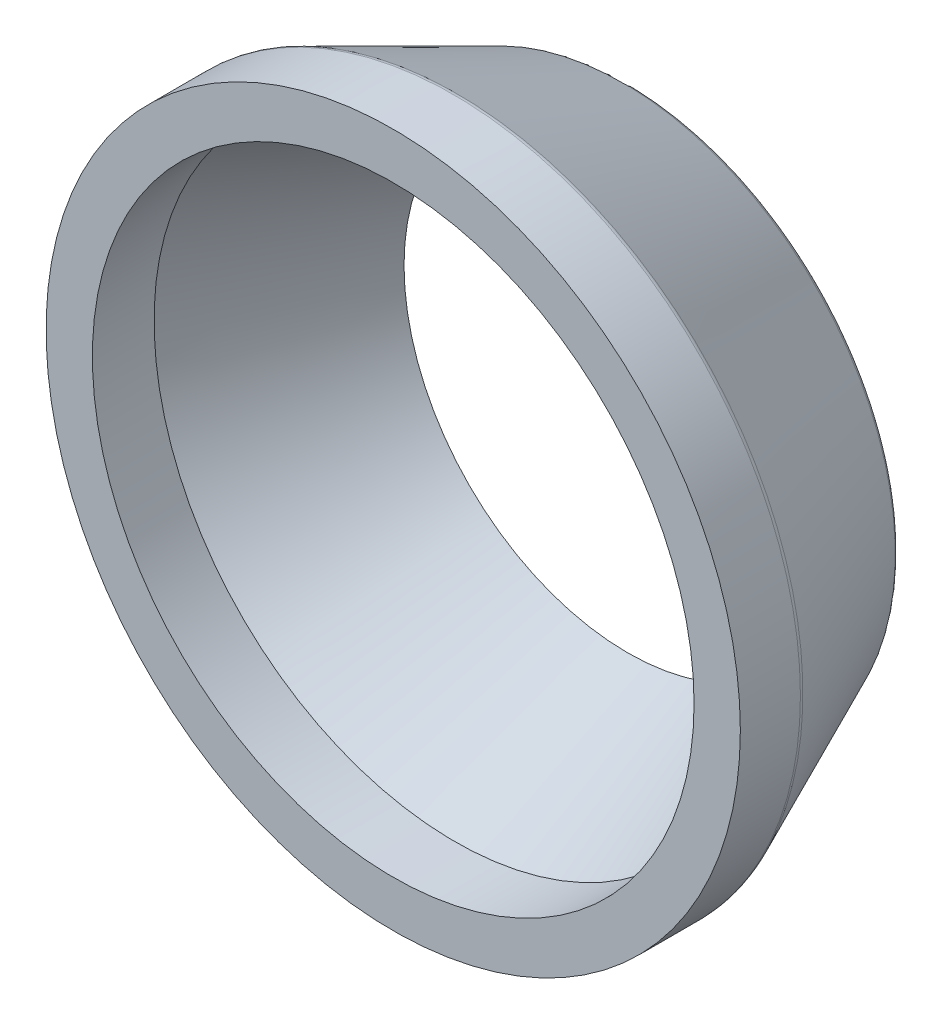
ISO-10303-21;
HEADER;
FILE_DESCRIPTION(('STEP AP214'),'2;1');
FILE_NAME('part.step','',(''),(''),'','','');
FILE_SCHEMA(('AUTOMOTIVE_DESIGN { 1 0 10303 214 1 1 1 1 }'));
ENDSEC;
DATA;
#1=APPLICATION_CONTEXT('core data for automotive mechanical design processes');
#2=APPLICATION_PROTOCOL_DEFINITION('international standard','automotive_design',2000,#1);
#3=PRODUCT_CONTEXT('',#1,'mechanical');
#4=PRODUCT('Part','Part','',(#3));
#5=PRODUCT_RELATED_PRODUCT_CATEGORY('part','',(#4));
#6=PRODUCT_DEFINITION_FORMATION('','',#4);
#7=PRODUCT_DEFINITION_CONTEXT('part definition',#1,'design');
#8=PRODUCT_DEFINITION('design','',#6,#7);
#9=PRODUCT_DEFINITION_SHAPE('','',#8);
#10=(LENGTH_UNIT() NAMED_UNIT(*) SI_UNIT(.MILLI.,.METRE.));
#11=(NAMED_UNIT(*) PLANE_ANGLE_UNIT() SI_UNIT($,.RADIAN.));
#12=(NAMED_UNIT(*) SI_UNIT($,.STERADIAN.) SOLID_ANGLE_UNIT());
#13=UNCERTAINTY_MEASURE_WITH_UNIT(LENGTH_MEASURE(1.E-05),#10,'distance_accuracy_value','');
#14=(GEOMETRIC_REPRESENTATION_CONTEXT(3) GLOBAL_UNCERTAINTY_ASSIGNED_CONTEXT((#13)) GLOBAL_UNIT_ASSIGNED_CONTEXT((#10,
#11,#12)) REPRESENTATION_CONTEXT('',''));
#15=CARTESIAN_POINT('',(0.,0.,0.));
#16=DIRECTION('',(0.,0.,1.));
#17=DIRECTION('',(1.,0.,0.));
#18=AXIS2_PLACEMENT_3D('',#15,#16,#17);
#19=CARTESIAN_POINT('',(19.5,0.,0.));
#20=DIRECTION('',(0.,0.,1.));
#21=DIRECTION('',(1.,0.,0.));
#22=AXIS2_PLACEMENT_3D('',#19,#20,#21);
#23=PLANE('',#22);
#24=CARTESIAN_POINT('',(0.,0.,0.));
#25=DIRECTION('',(0.,0.,1.));
#26=DIRECTION('',(1.,0.,0.));
#27=AXIS2_PLACEMENT_3D('',#24,#25,#26);
#28=CIRCLE('',#27,22.5);
#29=CARTESIAN_POINT('',(22.5,0.,0.));
#30=VERTEX_POINT('',#29);
#31=EDGE_CURVE('E51',#30,#30,#28,.T.);
#32=ORIENTED_EDGE('',*,*,#31,.T.);
#33=EDGE_LOOP('',(#32));
#34=FACE_BOUND('',#33,.T.);
#35=CARTESIAN_POINT('',(0.,0.,0.));
#36=DIRECTION('',(0.,0.,1.));
#37=DIRECTION('',(1.,0.,0.));
#38=AXIS2_PLACEMENT_3D('',#35,#36,#37);
#39=CIRCLE('',#38,19.5);
#40=CARTESIAN_POINT('',(19.5,0.,0.));
#41=VERTEX_POINT('',#40);
#42=EDGE_CURVE('E60',#41,#41,#39,.T.);
#43=ORIENTED_EDGE('',*,*,#42,.F.);
#44=EDGE_LOOP('',(#43));
#45=FACE_BOUND('',#44,.T.);
#46=ADVANCED_FACE('F31',(#34,#45),#23,.T.);
#47=CARTESIAN_POINT('',(0.,0.,16.8));
#48=DIRECTION('',(0.,0.,1.));
#49=DIRECTION('',(1.,0.,0.));
#50=AXIS2_PLACEMENT_3D('',#47,#48,#49);
#51=CYLINDRICAL_SURFACE('',#50,22.5);
#52=CARTESIAN_POINT('',(0.,0.,-3.89346015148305));
#53=DIRECTION('',(0.,0.,-1.));
#54=DIRECTION('',(-1.,0.,0.));
#55=AXIS2_PLACEMENT_3D('',#52,#53,#54);
#56=CIRCLE('',#55,22.5);
#57=CARTESIAN_POINT('',(-22.5,0.,-3.89346015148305));
#58=VERTEX_POINT('',#57);
#59=EDGE_CURVE('E10',#58,#58,#56,.F.);
#60=ORIENTED_EDGE('',*,*,#59,.T.);
#61=EDGE_LOOP('',(#60));
#62=FACE_BOUND('',#61,.T.);
#63=ORIENTED_EDGE('',*,*,#31,.F.);
#64=EDGE_LOOP('',(#63));
#65=FACE_BOUND('',#64,.T.);
#66=ADVANCED_FACE('F68',(#62,#65),#51,.T.);
#67=CARTESIAN_POINT('',(0.,0.,-4.));
#68=DIRECTION('',(0.,0.,1.));
#69=DIRECTION('',(1.,0.,0.));
#70=AXIS2_PLACEMENT_3D('',#67,#68,#69);
#71=CONICAL_SURFACE('',#70,22.5,0.419879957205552);
#72=CARTESIAN_POINT('',(0.,0.,-14.9038254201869));
#73=DIRECTION('',(0.,0.,-1.));
#74=DIRECTION('',(-1.,0.,0.));
#75=AXIS2_PLACEMENT_3D('',#72,#73,#74);
#76=CIRCLE('',#75,17.6322207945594);
#77=CARTESIAN_POINT('',(-17.6322207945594,0.,-14.9038254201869));
#78=VERTEX_POINT('',#77);
#79=EDGE_CURVE('E42',#78,#78,#76,.F.);
#80=ORIENTED_EDGE('',*,*,#79,.T.);
#81=EDGE_LOOP('',(#80));
#82=FACE_BOUND('',#81,.T.);
#83=CARTESIAN_POINT('',(0.,0.,-4.09728557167));
#84=DIRECTION('',(0.,0.,-1.));
#85=DIRECTION('',(-1.,0.,0.));
#86=AXIS2_PLACEMENT_3D('',#83,#84,#85);
#87=CIRCLE('',#86,22.4565689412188);
#88=CARTESIAN_POINT('',(-22.4565689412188,0.,-4.09728557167));
#89=VERTEX_POINT('',#88);
#90=EDGE_CURVE('E46',#89,#89,#87,.T.);
#91=ORIENTED_EDGE('',*,*,#90,.T.);
#92=EDGE_LOOP('',(#91));
#93=FACE_BOUND('',#92,.T.);
#94=ADVANCED_FACE('F74',(#82,#93),#71,.T.);
#95=CARTESIAN_POINT('',(17.5,0.,-15.2));
#96=DIRECTION('',(0.,0.,-1.));
#97=DIRECTION('',(-1.,0.,0.));
#98=AXIS2_PLACEMENT_3D('',#95,#96,#97);
#99=PLANE('',#98);
#100=CARTESIAN_POINT('',(0.,0.,-15.2));
#101=DIRECTION('',(0.,0.,-1.));
#102=DIRECTION('',(-1.,0.,0.));
#103=AXIS2_PLACEMENT_3D('',#100,#101,#102);
#104=CIRCLE('',#103,17.1756518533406);
#105=CARTESIAN_POINT('',(-17.1756518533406,0.,-15.2));
#106=VERTEX_POINT('',#105);
#107=EDGE_CURVE('E38',#106,#106,#104,.T.);
#108=ORIENTED_EDGE('',*,*,#107,.T.);
#109=EDGE_LOOP('',(#108));
#110=FACE_BOUND('',#109,.T.);
#111=CARTESIAN_POINT('',(0.,0.,-15.2));
#112=DIRECTION('',(0.,0.,1.));
#113=DIRECTION('',(1.,0.,0.));
#114=AXIS2_PLACEMENT_3D('',#111,#112,#113);
#115=CIRCLE('',#114,14.5);
#116=CARTESIAN_POINT('',(14.5,0.,-15.2));
#117=VERTEX_POINT('',#116);
#118=EDGE_CURVE('E54',#117,#117,#115,.T.);
#119=ORIENTED_EDGE('',*,*,#118,.T.);
#120=EDGE_LOOP('',(#119));
#121=FACE_BOUND('',#120,.T.);
#122=ADVANCED_FACE('F92',(#110,#121),#99,.T.);
#123=CARTESIAN_POINT('',(0.,0.,-15.2));
#124=DIRECTION('',(0.,0.,1.));
#125=DIRECTION('',(1.,0.,0.));
#126=AXIS2_PLACEMENT_3D('',#123,#124,#125);
#127=CONICAL_SURFACE('',#126,14.5,0.419879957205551);
#128=CARTESIAN_POINT('',(0.,0.,-4.));
#129=DIRECTION('',(0.,0.,1.));
#130=DIRECTION('',(1.,0.,0.));
#131=AXIS2_PLACEMENT_3D('',#128,#129,#130);
#132=CIRCLE('',#131,19.5);
#133=CARTESIAN_POINT('',(19.5,0.,-4.));
#134=VERTEX_POINT('',#133);
#135=EDGE_CURVE('E57',#134,#134,#132,.T.);
#136=ORIENTED_EDGE('',*,*,#135,.T.);
#137=EDGE_LOOP('',(#136));
#138=FACE_BOUND('',#137,.T.);
#139=ORIENTED_EDGE('',*,*,#118,.F.);
#140=EDGE_LOOP('',(#139));
#141=FACE_BOUND('',#140,.T.);
#142=ADVANCED_FACE('F85',(#138,#141),#127,.F.);
#143=CARTESIAN_POINT('',(0.,0.,16.8));
#144=DIRECTION('',(0.,0.,1.));
#145=DIRECTION('',(1.,0.,0.));
#146=AXIS2_PLACEMENT_3D('',#143,#144,#145);
#147=CYLINDRICAL_SURFACE('',#146,19.5);
#148=ORIENTED_EDGE('',*,*,#42,.T.);
#149=EDGE_LOOP('',(#148));
#150=FACE_BOUND('',#149,.T.);
#151=ORIENTED_EDGE('',*,*,#135,.F.);
#152=EDGE_LOOP('',(#151));
#153=FACE_BOUND('',#152,.T.);
#154=ADVANCED_FACE('F64',(#150,#153),#147,.F.);
#155=CARTESIAN_POINT('',(0.,0.,-14.7));
#156=DIRECTION('',(0.,0.,-1.));
#157=DIRECTION('',(-1.,0.,0.));
#158=AXIS2_PLACEMENT_3D('',#155,#156,#157);
#159=TOROIDAL_SURFACE('',#158,17.1756518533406,0.5);
#160=ORIENTED_EDGE('',*,*,#107,.F.);
#161=EDGE_LOOP('',(#160));
#162=FACE_BOUND('',#161,.T.);
#163=ORIENTED_EDGE('',*,*,#79,.F.);
#164=EDGE_LOOP('',(#163));
#165=FACE_BOUND('',#164,.T.);
#166=ADVANCED_FACE('F77',(#162,#165),#159,.T.);
#167=CARTESIAN_POINT('',(0.,0.,-3.89346015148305));
#168=DIRECTION('',(0.,0.,-1.));
#169=DIRECTION('',(-1.,0.,0.));
#170=AXIS2_PLACEMENT_3D('',#167,#168,#169);
#171=TOROIDAL_SURFACE('',#170,22.,0.5);
#172=ORIENTED_EDGE('',*,*,#90,.F.);
#173=EDGE_LOOP('',(#172));
#174=FACE_BOUND('',#173,.T.);
#175=ORIENTED_EDGE('',*,*,#59,.F.);
#176=EDGE_LOOP('',(#175));
#177=FACE_BOUND('',#176,.T.);
#178=ADVANCED_FACE('F33',(#174,#177),#171,.T.);
#179=CLOSED_SHELL('',(#46,#66,#94,#122,#142,#154,#166,#178));
#180=MANIFOLD_SOLID_BREP('B2',#179);
#181=ADVANCED_BREP_SHAPE_REPRESENTATION('',(#18,#180),#14);
#182=SHAPE_DEFINITION_REPRESENTATION(#9,#181);
ENDSEC;
END-ISO-10303-21;
